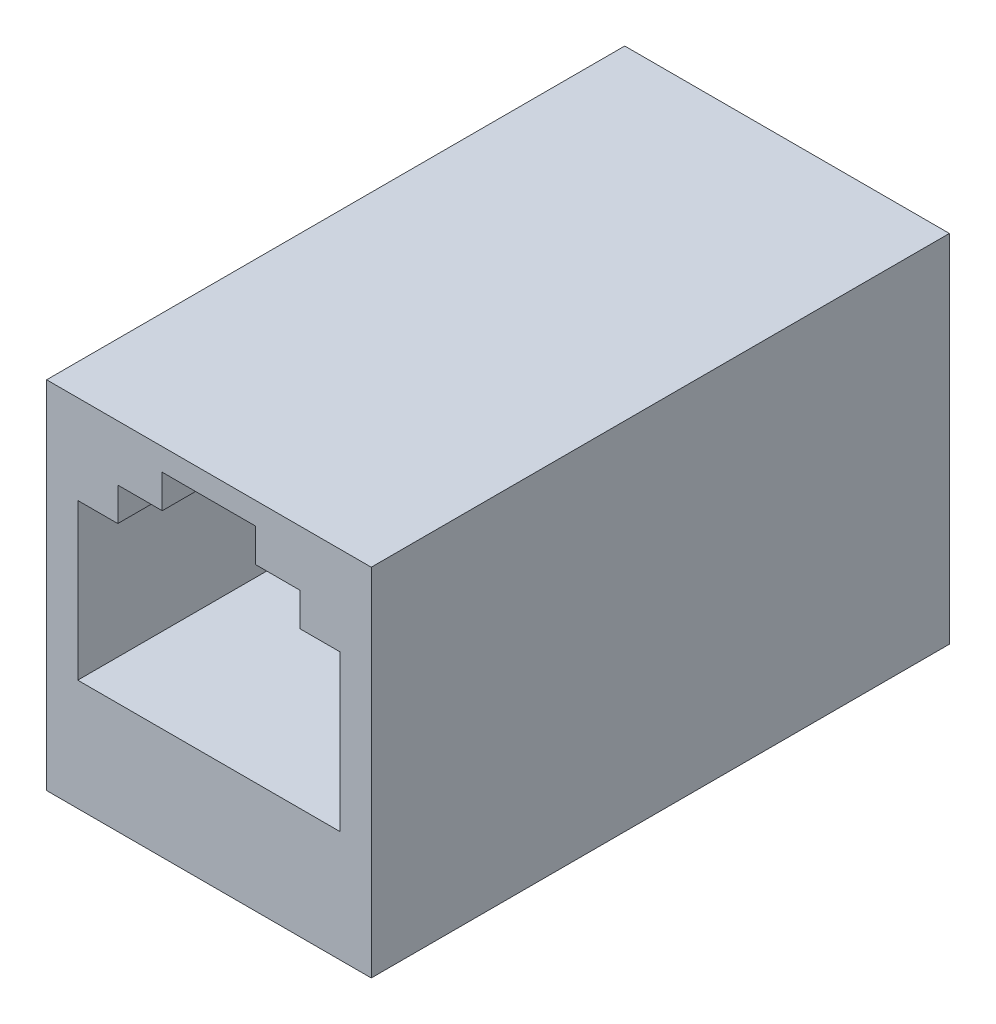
from build123d import *

# Parameters (mm, degrees)
SKETCH1_W                      = 15
SKETCH1_H                      = 14.5
BOSS_EXTRUDE1_DEPTH            = 13
SKETCH3_W                      = 13
SKETCH3_H                      = 2
CUT_EXTRUDE1_DEPTH             = 10
SKETCH2_W                      = 1.1
SKETCH2_H                      = 1.1
BOSS_EXTRUDE2_DEPTH            = 10
SKETCH4_W                      = 11.8
SKETCH4_H                      = 7
CUT_EXTRUDE2_DEPTH             = 12
SKETCH6_W                      = 8.2
SKETCH6_H                      = 1.5
CUT_EXTRUDE4_DEPTH             = 12
SKETCH8_W                      = 4.2
SKETCH8_H                      = 1.5
CUT_EXTRUDE5_DEPTH             = 13
CUT_EXTRUDE6_REACH             = 25.25
CUT_EXTRUDE6_DIRECTION_2_REACH = 25.25
SKETCH10_W                     = 1.8
SKETCH10_H                     = 1
BOSS_EXTRUDE3_DEPTH            = 2
SKETCH26_W                     = 1.1
SKETCH26_H                     = 1.1
CUT_EXTRUDE9_DEPTH             = 20.077735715
SKETCH28_W                     = 15
SKETCH28_H                     = 1.5
BOSS_EXTRUDE4_DEPTH            = 13
SKETCH29_W                     = 15
SKETCH29_H                     = 16
BOSS_EXTRUDE5_DEPTH            = 13
SKETCH31_W                     = 0.2
SKETCH31_H                     = 16
CUT_EXTRUDE10_DEPTH            = 31.700162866


with BuildPart() as part:
    # Sketch1 → Boss-Extrude1 (new body)
    with BuildSketch(Plane.XY):
        with Locations((0, 7.25)):
            Rectangle(SKETCH1_W, SKETCH1_H)
    extrude(amount=-BOSS_EXTRUDE1_DEPTH)

    # Sketch3 → Cut-Extrude1 (cut)
    with BuildSketch(Plane(origin=(0, 0, -13), x_dir=(-1, 0, 0), z_dir=(0, 0, -1))):
        with Locations((0, 12.5)):
            Rectangle(SKETCH3_W, SKETCH3_H)
    extrude(amount=-CUT_EXTRUDE1_DEPTH, mode=Mode.SUBTRACT)

    # Sketch2 → Boss-Extrude2 (add)
    with BuildSketch(Plane(origin=(0, 13.5, 0), x_dir=(1, 0, 0), z_dir=(0, 1, 0))):
        with Locations((-8.05, 2.75)):
            Rectangle(SKETCH2_W, SKETCH2_H)
        with Locations((8.05, 2.75)):
            Rectangle(SKETCH2_W, SKETCH2_H)
    extrude(amount=-BOSS_EXTRUDE2_DEPTH)

    # Sketch4 → Cut-Extrude2 (cut)
    with BuildSketch(Plane.XY):
        with Locations((0, 7)):
            Rectangle(SKETCH4_W, SKETCH4_H)
    extrude(amount=-CUT_EXTRUDE2_DEPTH, mode=Mode.SUBTRACT)

    # Sketch6 → Cut-Extrude4 (cut)
    with BuildSketch(Plane.XY):
        with Locations((0, 11.25)):
            Rectangle(SKETCH6_W, SKETCH6_H)
    extrude(amount=-CUT_EXTRUDE4_DEPTH, mode=Mode.SUBTRACT)

    # Sketch8 → Cut-Extrude5 (cut)
    with BuildSketch(Plane.XY):
        with Locations((0, 12.75)):
            Rectangle(SKETCH8_W, SKETCH8_H)
    extrude(amount=-CUT_EXTRUDE5_DEPTH, mode=Mode.SUBTRACT)

    # Cut-Extrude6: up to this face of the body (flat: up to its plane)
    cut_extrude6_end = Plane(part.part.faces().sort_by_distance((6.5, 12.5, -8))[0])
    # Sketch9 → Cut-Extrude6 (cut, up to the picked face)
    with BuildSketch(Plane.ZY.offset(-4.1), mode=Mode.PRIVATE) as cut_extrude6_sk1:
        Polygon((-3, 11.5), (-13, 10.5), (-13, 11.5), align=None)
    cut_extrude6_tool1 = split(extrude(cut_extrude6_sk1.sketch, amount=-CUT_EXTRUDE6_REACH, mode=Mode.PRIVATE), bisect_by=cut_extrude6_end, keep=Keep.BOTH, mode=Mode.PRIVATE)
    add(cut_extrude6_tool1.solids().sort_by(Axis((4.1, 11.166667, -9.666667), (1, 0, 0)))[0], mode=Mode.SUBTRACT)

    # Cut-Extrude6 direction 2: up to this face of the body (flat: up to its plane)
    cut_extrude6_direction_2_end = Plane(part.part.faces().sort_by_distance((-6.5, 12.5, -8))[0])
    # Sketch9 → Cut-Extrude6 direction 2 (cut, up to the picked face)
    with BuildSketch(Plane.ZY.offset(-4.1), mode=Mode.PRIVATE) as cut_extrude6_direction_2_sk1:
        Polygon((-3, 11.5), (-13, 10.5), (-13, 11.5), align=None)
    cut_extrude6_direction_2_tool1 = split(extrude(cut_extrude6_direction_2_sk1.sketch, amount=CUT_EXTRUDE6_DIRECTION_2_REACH, mode=Mode.PRIVATE), bisect_by=cut_extrude6_direction_2_end, keep=Keep.BOTH, mode=Mode.PRIVATE)
    add(cut_extrude6_direction_2_tool1.solids().sort_by(Axis((4.1, 11.166667, -9.666667), (-1, 0, 0)))[0], mode=Mode.SUBTRACT)

    # Sketch10 → Boss-Extrude3 (add)
    with BuildSketch(Plane.XY.offset(-12)):
        with Locations((-5, 10)):
            Rectangle(SKETCH10_W, SKETCH10_H)
    boss_extrude3 = extrude(amount=BOSS_EXTRUDE3_DEPTH)

    # Mirror1: Boss-Extrude3 across plane
    add(boss_extrude3.mirror(Plane(origin=(0, 0, 0), x_dir=(0, 0, 1), z_dir=(1, 0, 0))))

    # Sketch26 → Cut-Extrude9 (cut, through all)
    with BuildSketch(Plane.XZ.offset(-3.5)):
        with Locations((8.05, -2.75)):
            Rectangle(SKETCH26_W, SKETCH26_H)
    cut_extrude9 = extrude(amount=-CUT_EXTRUDE9_DEPTH, mode=Mode.SUBTRACT)

    # Mirror2: Cut-Extrude9 across plane
    add(cut_extrude9.mirror(Plane(origin=(0, 0, 0), x_dir=(0, 0, 1), z_dir=(1, 0, 0))), mode=Mode.SUBTRACT)

    # Sketch28 → Boss-Extrude4 (add)
    with BuildSketch(Plane.XY):
        with Locations((0, -0.75)):
            Rectangle(SKETCH28_W, SKETCH28_H)
    extrude(amount=-BOSS_EXTRUDE4_DEPTH)

    # Sketch29 → Boss-Extrude5 (add)
    with BuildSketch(Plane(origin=(0, 0, -13), x_dir=(-1, 0, 0), z_dir=(0, 0, -1))):
        with Locations((0, 6.5)):
            Rectangle(SKETCH29_W, SKETCH29_H)
    extrude(amount=BOSS_EXTRUDE5_DEPTH)

    # Sketch31 → Cut-Extrude10 (cut, through all)
    with BuildSketch(Plane.XY):
        with Locations((-7.4, 6.5)):
            Rectangle(SKETCH31_W, SKETCH31_H)
    cut_extrude10 = extrude(amount=-CUT_EXTRUDE10_DEPTH, mode=Mode.SUBTRACT)

    # Mirror3: Cut-Extrude10 across plane
    add(cut_extrude10.mirror(Plane(origin=(0, 0, 0), x_dir=(0, 0, 1), z_dir=(1, 0, 0))), mode=Mode.SUBTRACT)


solid = part.part
